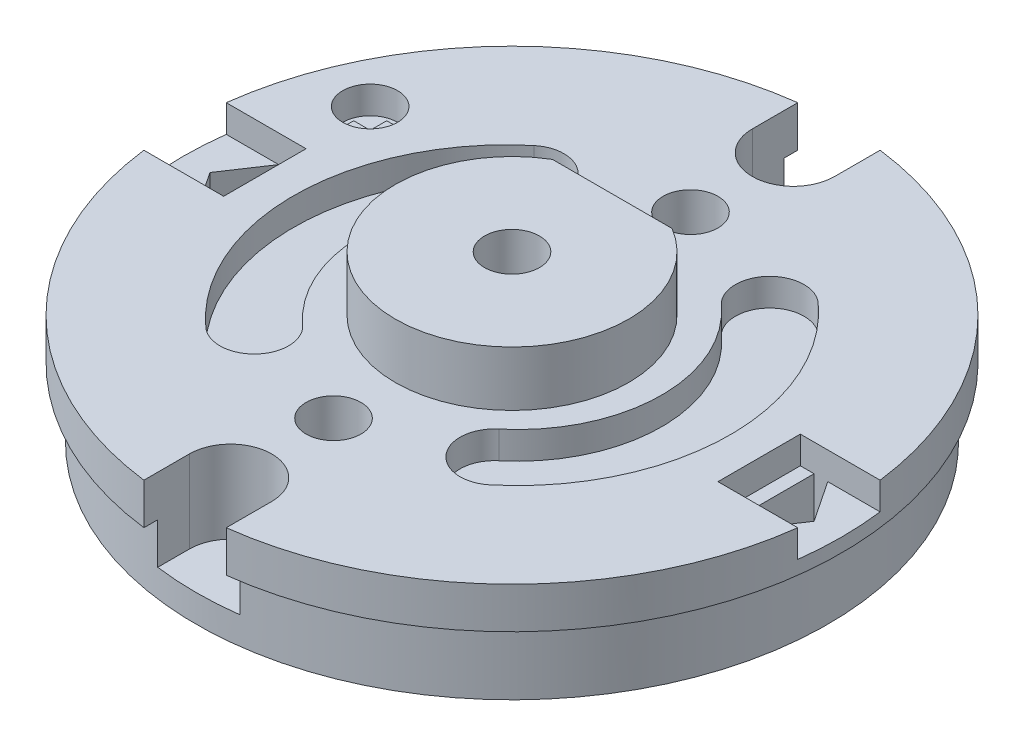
from build123d import *

# Parameters (mm, degrees)
ESQUISSE2_R                          = 1
ENL_V_MAT_EXTRU_2_DEPTH              = 19
ENL_V_DE_MAT_EXTRU_MINCE1_DEPTH      = 19
ENL_V_DE_MAT_EXTRU_MINCE1_DEPTH_BACK = 19
ESQUISSE6_W                          = 10
ESQUISSE6_H                          = 3.390207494
ENL_V_MAT_EXTRU_6_DEPTH              = 1
ENL_V_MAT_EXTRU_7_DEPTH              = 3
ENL_V_MAT_EXTRU_8_DEPTH              = 18.435595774
ESQUISSE13_W                         = 5.473530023
ESQUISSE13_H                         = 3
ENL_V_MAT_EXTRU_9_DEPTH              = 1
ESQUISSE14_R                         = 1
ENL_V_MAT_EXTRU_10_DEPTH             = 1
R_P_TITION_CIRCULAIRE2_COUNT         = 2
EXTRUSION1_DEPTH                     = 0.1


with BuildPart() as part:
    # Esquisse1 → R_volution1 (revolve)
    with BuildSketch(Plane.XY, mode=Mode.PRIVATE) as r_volution1_sk:
        Polygon((-8.5, 0), (-8.5, 2.5), (-1, 2.5), (-1, 6), (-4.25, 6), (-4.25, 4), (-12, 4), (-12, 2.5), (-11.5, 2.5), (-11.5, 0), align=None)
    revolve(r_volution1_sk.sketch.rotate(Axis((0, 0, 0), (0, 1, 0)), 270), axis=Axis((0, 0, 0), (0, 1, 0)))

    # Esquisse2 → Enl_v. mat.-Extru.2 (cut, through all)
    with BuildSketch(Plane(origin=(0, 0, 0), x_dir=(1, 0, 0), z_dir=(0, 1, 0))):
        with Locations(Location((0, 6.5, 0), (0, 0, 90))):
            Circle(ESQUISSE2_R)
    enl_v_mat_extru_2 = extrude(amount=ENL_V_MAT_EXTRU_2_DEPTH, mode=Mode.SUBTRACT)

    # Esquisse6 → Enl_v. de mat.-Extru.-Mince1 (cut, two sides: drawn at the far end of the back side and taken through both)
    with BuildSketch(Plane(origin=(0, 0, 0), x_dir=(0, 0, -1), z_dir=(1, 0, 0)).offset(-ENL_V_DE_MAT_EXTRU_MINCE1_DEPTH_BACK)):
        with Locations((8.65, 5.695103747)):
            Rectangle(ESQUISSE6_W, ESQUISSE6_H)
    extrude(amount=ENL_V_DE_MAT_EXTRU_MINCE1_DEPTH + ENL_V_DE_MAT_EXTRU_MINCE1_DEPTH_BACK, mode=Mode.SUBTRACT)

    # Esquisse8 → Enl_v. mat.-Extru.6 (cut)
    with BuildSketch(Plane(origin=(0, 4, 0), x_dir=(1, 0, 0), z_dir=(0, 1, 0))):
        with BuildLine():
            ThreePointArc((-4.94917232, 5.753130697), (-7.745570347, -0.050703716), (-5.187679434, -5.963531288))
            ThreePointArc((-5.187679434, -5.963531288), (-3.422259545, -5.872467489), (-3.513323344, -4.1070476))
            ThreePointArc((-3.513323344, -4.1070476), (-5.246088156, -0.10158376), (-3.351754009, 3.830046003))
            ThreePointArc((-3.351754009, 3.830046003), (-3.188920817, 5.590297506), (-4.94917232, 5.753130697))
        make_face()
    enl_v_mat_extru_6 = extrude(amount=-ENL_V_MAT_EXTRU_6_DEPTH, mode=Mode.SUBTRACT)

    # Esquisse9 → Enl_v. mat.-Extru.7 (cut)
    with BuildSketch(Plane(origin=(0, 4, 0), x_dir=(1, 0, 0), z_dir=(0, 1, 0))):
        with BuildLine():
            Line((-1.5, 10.25), (-1.5, 15))
            Line((-1.5, 15), (1.5, 15))
            Line((1.5, 15), (1.5, 10.25))
            ThreePointArc((1.5, 10.25), (0, 8.75), (-1.5, 10.25))
        make_face()
    enl_v_mat_extru_7 = extrude(amount=-ENL_V_MAT_EXTRU_7_DEPTH, mode=Mode.SUBTRACT)

    # Esquisse12 → Enl_v. mat.-Extru.8 (cut, through all)
    with BuildSketch(Plane(origin=(0, 4, 0), x_dir=(1, 0, 0), z_dir=(0, 1, 0))):
        Polygon((-11, 0), (-10, 1.5), (-9.5, 1.5), (-9.5, -1.5), (-10, -1.5), align=None)
    enl_v_mat_extru_8 = extrude(amount=-ENL_V_MAT_EXTRU_8_DEPTH, mode=Mode.SUBTRACT)

    # Esquisse13 → Enl_v. mat.-Extru.9 (cut)
    with BuildSketch(Plane(origin=(0, 4, 0), x_dir=(1, 0, 0), z_dir=(0, 1, 0))):
        with Locations((-11.736765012, 0)):
            Rectangle(ESQUISSE13_W, ESQUISSE13_H)
    enl_v_mat_extru_9 = extrude(amount=-ENL_V_MAT_EXTRU_9_DEPTH, mode=Mode.SUBTRACT)

    # Esquisse14 → Enl_v. mat.-Extru.10 (cut)
    with BuildSketch(Plane(origin=(0, 4, 0), x_dir=(1, 0, 0), z_dir=(0, 1, 0))):
        with Locations(Location((-9.16515139, 4, 0), (0, 0, 270))):
            Circle(ESQUISSE14_R)
    extrude(amount=-ENL_V_MAT_EXTRU_10_DEPTH, mode=Mode.SUBTRACT)

    # R_p_tition circulaire2: Enl_v. mat.-Extru.2, Enl_v. mat.-Extru.6, Enl_v. mat.-Extru.7, Enl_v. mat.-Extru.8, Enl_v. mat.-Extru.9 ×2 about axis
    r_p_tition_circulaire2_axis = Axis((0, 0, 0), (0, 1, 0))
    add([enl_v_mat_extru_2.rotate(r_p_tition_circulaire2_axis, i * 360 / R_P_TITION_CIRCULAIRE2_COUNT) for i in range(1, R_P_TITION_CIRCULAIRE2_COUNT)], mode=Mode.SUBTRACT)
    add([enl_v_mat_extru_6.rotate(r_p_tition_circulaire2_axis, i * 360 / R_P_TITION_CIRCULAIRE2_COUNT) for i in range(1, R_P_TITION_CIRCULAIRE2_COUNT)], mode=Mode.SUBTRACT)
    add([enl_v_mat_extru_7.rotate(r_p_tition_circulaire2_axis, i * 360 / R_P_TITION_CIRCULAIRE2_COUNT) for i in range(1, R_P_TITION_CIRCULAIRE2_COUNT)], mode=Mode.SUBTRACT)
    add([enl_v_mat_extru_8.rotate(r_p_tition_circulaire2_axis, i * 360 / R_P_TITION_CIRCULAIRE2_COUNT) for i in range(1, R_P_TITION_CIRCULAIRE2_COUNT)], mode=Mode.SUBTRACT)
    add([enl_v_mat_extru_9.rotate(r_p_tition_circulaire2_axis, i * 360 / R_P_TITION_CIRCULAIRE2_COUNT) for i in range(1, R_P_TITION_CIRCULAIRE2_COUNT)], mode=Mode.SUBTRACT)

    # Esquisse15 → Extrusion1 (add)
    with BuildSketch(Plane(origin=(0, 3, 0), x_dir=(1, 0, 0), z_dir=(0, 1, 0))):
        Polygon((-9.91515139, 4.15), (-9.31415139, 4.15), (-9.31415139, 4.751), (-9.01415139, 4.751), (-9.01415139, 4.15), (-8.41515139, 4.15), (-8.41515139, 3.85), (-9.01415139, 3.85), (-9.01415139, 3.251), (-9.31415139, 3.251), (-9.31415139, 3.85), (-9.91515139, 3.85), align=None)
    extrude(amount=EXTRUSION1_DEPTH)


solid = part.part
